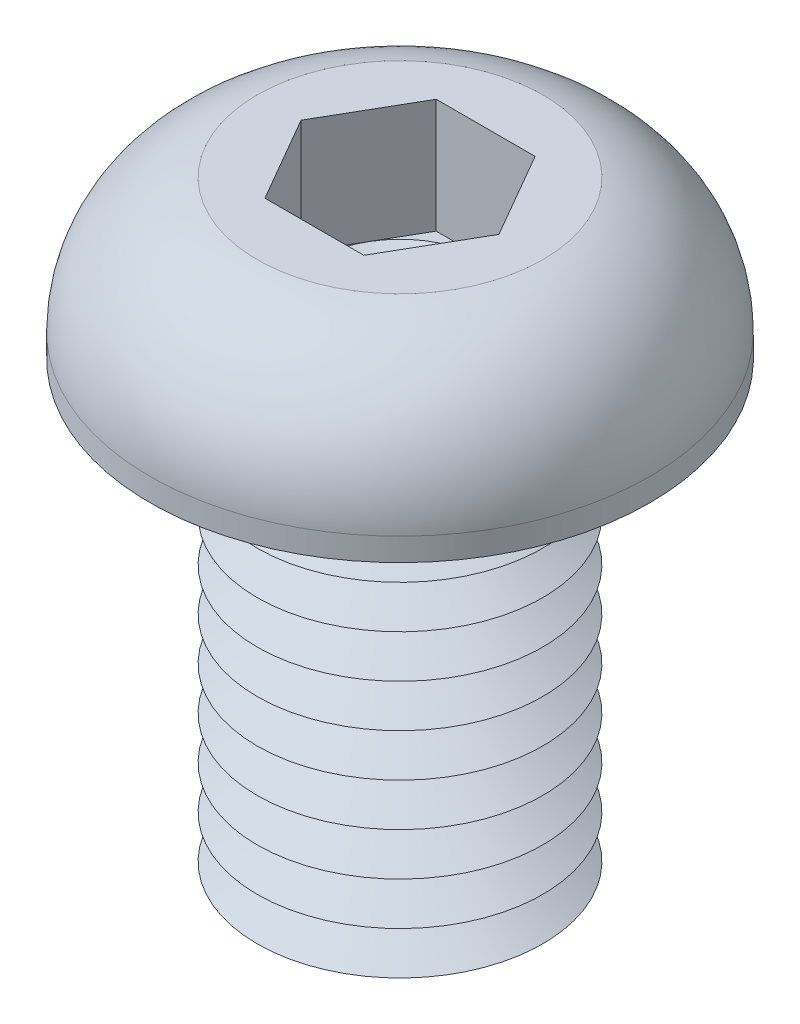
ISO-10303-21;
HEADER;
FILE_DESCRIPTION(('STEP AP214'),'2;1');
FILE_NAME('part.step','',(''),(''),'','','');
FILE_SCHEMA(('AUTOMOTIVE_DESIGN { 1 0 10303 214 1 1 1 1 }'));
ENDSEC;
DATA;
#1=APPLICATION_CONTEXT('core data for automotive mechanical design processes');
#2=APPLICATION_PROTOCOL_DEFINITION('international standard','automotive_design',2000,#1);
#3=PRODUCT_CONTEXT('',#1,'mechanical');
#4=PRODUCT('Part','Part','',(#3));
#5=PRODUCT_RELATED_PRODUCT_CATEGORY('part','',(#4));
#6=PRODUCT_DEFINITION_FORMATION('','',#4);
#7=PRODUCT_DEFINITION_CONTEXT('part definition',#1,'design');
#8=PRODUCT_DEFINITION('design','',#6,#7);
#9=PRODUCT_DEFINITION_SHAPE('','',#8);
#10=(LENGTH_UNIT() NAMED_UNIT(*) SI_UNIT(.MILLI.,.METRE.));
#11=(NAMED_UNIT(*) PLANE_ANGLE_UNIT() SI_UNIT($,.RADIAN.));
#12=(NAMED_UNIT(*) SI_UNIT($,.STERADIAN.) SOLID_ANGLE_UNIT());
#13=UNCERTAINTY_MEASURE_WITH_UNIT(LENGTH_MEASURE(1.E-05),#10,'distance_accuracy_value','');
#14=(GEOMETRIC_REPRESENTATION_CONTEXT(3) GLOBAL_UNCERTAINTY_ASSIGNED_CONTEXT((#13)) GLOBAL_UNIT_ASSIGNED_CONTEXT((#10,
#11,#12)) REPRESENTATION_CONTEXT('',''));
#15=CARTESIAN_POINT('',(0.,0.,0.));
#16=DIRECTION('',(0.,0.,1.));
#17=DIRECTION('',(1.,0.,0.));
#18=AXIS2_PLACEMENT_3D('',#15,#16,#17);
#19=CARTESIAN_POINT('',(0.,0.,0.));
#20=DIRECTION('',(0.,-1.,0.));
#21=DIRECTION('',(0.,0.,-1.));
#22=AXIS2_PLACEMENT_3D('',#19,#20,#21);
#23=TOROIDAL_SURFACE('',#22,5.75,0.75);
#24=CARTESIAN_POINT('',(0.,0.,-6.5));
#25=VERTEX_POINT('',#24);
#26=VERTEX_LOOP('',#25);
#27=FACE_BOUND('',#26,.T.);
#28=ADVANCED_FACE('P0_F12',(#27),#23,.T.);
#29=CLOSED_SHELL('',(#28));
#30=MANIFOLD_SOLID_BREP('P0_B1',#29);
#31=CARTESIAN_POINT('',(1.73205080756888,1.5,-3.));
#32=DIRECTION('',(0.,1.,0.));
#33=DIRECTION('',(0.,0.,1.));
#34=AXIS2_PLACEMENT_3D('',#31,#32,#33);
#35=PLANE('',#34);
#36=CARTESIAN_POINT('',(0.,1.5,0.));
#37=DIRECTION('',(0.,1.,0.));
#38=DIRECTION('',(0.,0.,1.));
#39=AXIS2_PLACEMENT_3D('',#36,#37,#38);
#40=CIRCLE('',#39,3.);
#41=CARTESIAN_POINT('',(0.,1.5,3.));
#42=VERTEX_POINT('',#41);
#43=CARTESIAN_POINT('',(2.59807621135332,1.5,1.5));
#44=VERTEX_POINT('',#43);
#45=EDGE_CURVE('P1_E93',#42,#44,#40,.T.);
#46=ORIENTED_EDGE('',*,*,#45,.F.);
#47=DIRECTION('',(1.,0.,0.));
#48=VECTOR('',#47,1.);
#49=CARTESIAN_POINT('',(-1.73205080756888,1.5,3.));
#50=LINE('',#49,#48);
#51=CARTESIAN_POINT('',(1.73205080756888,1.5,3.));
#52=VERTEX_POINT('',#51);
#53=EDGE_CURVE('P1_E116',#42,#52,#50,.T.);
#54=ORIENTED_EDGE('',*,*,#53,.T.);
#55=DIRECTION('',(0.5,0.,-0.866025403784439));
#56=VECTOR('',#55,1.);
#57=CARTESIAN_POINT('',(1.73205080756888,1.5,3.));
#58=LINE('',#57,#56);
#59=EDGE_CURVE('P1_E112',#52,#44,#58,.T.);
#60=ORIENTED_EDGE('',*,*,#59,.T.);
#61=EDGE_LOOP('',(#46,#54,#60));
#62=FACE_BOUND('',#61,.T.);
#63=ADVANCED_FACE('P1_F15',(#62),#35,.T.);
#64=CARTESIAN_POINT('',(0.,1.5,0.));
#65=DIRECTION('',(0.,1.,0.));
#66=DIRECTION('',(0.,0.,1.));
#67=AXIS2_PLACEMENT_3D('',#64,#65,#66);
#68=CIRCLE('',#67,3.);
#69=CARTESIAN_POINT('',(2.59807621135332,1.5,-1.5));
#70=VERTEX_POINT('',#69);
#71=EDGE_CURVE('P1_E10',#44,#70,#68,.T.);
#72=ORIENTED_EDGE('',*,*,#71,.F.);
#73=CARTESIAN_POINT('',(3.46410161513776,1.5,0.));
#74=VERTEX_POINT('',#73);
#75=EDGE_CURVE('P1_E104',#44,#74,#58,.T.);
#76=ORIENTED_EDGE('',*,*,#75,.T.);
#77=DIRECTION('',(-0.5,0.,-0.866025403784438));
#78=VECTOR('',#77,1.);
#79=CARTESIAN_POINT('',(3.46410161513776,1.5,0.));
#80=LINE('',#79,#78);
#81=EDGE_CURVE('P1_E107',#74,#70,#80,.T.);
#82=ORIENTED_EDGE('',*,*,#81,.T.);
#83=EDGE_LOOP('',(#72,#76,#82));
#84=FACE_BOUND('',#83,.T.);
#85=ADVANCED_FACE('P1_F103',(#84),#35,.T.);
#86=CARTESIAN_POINT('',(0.,1.5,-3.));
#87=VERTEX_POINT('',#86);
#88=EDGE_CURVE('P1_E24',#70,#87,#68,.T.);
#89=ORIENTED_EDGE('',*,*,#88,.F.);
#90=CARTESIAN_POINT('',(1.73205080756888,1.5,-3.));
#91=VERTEX_POINT('',#90);
#92=EDGE_CURVE('P1_E139',#70,#91,#80,.T.);
#93=ORIENTED_EDGE('',*,*,#92,.T.);
#94=DIRECTION('',(-1.,0.,0.));
#95=VECTOR('',#94,1.);
#96=CARTESIAN_POINT('',(1.73205080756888,1.5,-3.));
#97=LINE('',#96,#95);
#98=EDGE_CURVE('P1_E282',#91,#87,#97,.T.);
#99=ORIENTED_EDGE('',*,*,#98,.T.);
#100=EDGE_LOOP('',(#89,#93,#99));
#101=FACE_BOUND('',#100,.T.);
#102=ADVANCED_FACE('P1_F247',(#101),#35,.T.);
#103=CARTESIAN_POINT('',(-2.59807621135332,1.5,-1.5));
#104=VERTEX_POINT('',#103);
#105=EDGE_CURVE('P1_E277',#87,#104,#68,.T.);
#106=ORIENTED_EDGE('',*,*,#105,.F.);
#107=CARTESIAN_POINT('',(-1.73205080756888,1.5,-3.));
#108=VERTEX_POINT('',#107);
#109=EDGE_CURVE('P1_E286',#87,#108,#97,.T.);
#110=ORIENTED_EDGE('',*,*,#109,.T.);
#111=DIRECTION('',(-0.5,0.,0.866025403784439));
#112=VECTOR('',#111,1.);
#113=CARTESIAN_POINT('',(-1.73205080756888,1.5,-3.));
#114=LINE('',#113,#112);
#115=EDGE_CURVE('P1_E281',#108,#104,#114,.T.);
#116=ORIENTED_EDGE('',*,*,#115,.T.);
#117=EDGE_LOOP('',(#106,#110,#116));
#118=FACE_BOUND('',#117,.T.);
#119=ADVANCED_FACE('P1_F261',(#118),#35,.T.);
#120=CARTESIAN_POINT('',(-2.59807621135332,1.5,1.5));
#121=VERTEX_POINT('',#120);
#122=EDGE_CURVE('P1_E31',#104,#121,#68,.T.);
#123=ORIENTED_EDGE('',*,*,#122,.F.);
#124=CARTESIAN_POINT('',(-3.46410161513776,1.5,0.));
#125=VERTEX_POINT('',#124);
#126=EDGE_CURVE('P1_E273',#104,#125,#114,.T.);
#127=ORIENTED_EDGE('',*,*,#126,.T.);
#128=DIRECTION('',(0.5,0.,0.866025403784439));
#129=VECTOR('',#128,1.);
#130=CARTESIAN_POINT('',(-3.46410161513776,1.5,0.));
#131=LINE('',#130,#129);
#132=EDGE_CURVE('P1_E276',#125,#121,#131,.T.);
#133=ORIENTED_EDGE('',*,*,#132,.T.);
#134=EDGE_LOOP('',(#123,#127,#133));
#135=FACE_BOUND('',#134,.T.);
#136=ADVANCED_FACE('P1_F252',(#135),#35,.T.);
#137=CARTESIAN_POINT('',(0.,-14.5,0.));
#138=DIRECTION('',(0.,1.,0.));
#139=DIRECTION('',(0.,0.,1.));
#140=AXIS2_PLACEMENT_3D('',#137,#138,#139);
#141=CONICAL_SURFACE('',#140,3.70096189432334,1.0471975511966);
#142=CARTESIAN_POINT('',(0.,-13.75,0.));
#143=DIRECTION('',(0.,-1.,0.));
#144=DIRECTION('',(0.,0.,-1.));
#145=AXIS2_PLACEMENT_3D('',#142,#143,#144);
#146=CIRCLE('',#145,5.);
#147=CARTESIAN_POINT('',(0.,-13.75,-5.));
#148=VERTEX_POINT('',#147);
#149=EDGE_CURVE('P1_E209',#148,#148,#146,.T.);
#150=ORIENTED_EDGE('',*,*,#149,.T.);
#151=EDGE_LOOP('',(#150));
#152=FACE_BOUND('',#151,.T.);
#153=CARTESIAN_POINT('',(0.,-14.5,0.));
#154=DIRECTION('',(0.,-1.,0.));
#155=DIRECTION('',(0.,0.,-1.));
#156=AXIS2_PLACEMENT_3D('',#153,#154,#155);
#157=CIRCLE('',#156,3.70096189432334);
#158=CARTESIAN_POINT('',(0.,-14.5,-3.70096189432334));
#159=VERTEX_POINT('',#158);
#160=EDGE_CURVE('P1_E212',#159,#159,#157,.T.);
#161=ORIENTED_EDGE('',*,*,#160,.F.);
#162=EDGE_LOOP('',(#161));
#163=FACE_BOUND('',#162,.T.);
#164=ADVANCED_FACE('P1_F260',(#152,#163),#141,.T.);
#165=CARTESIAN_POINT('',(0.,-15.25,0.));
#166=DIRECTION('',(0.,-1.,0.));
#167=DIRECTION('',(0.,0.,-1.));
#168=AXIS2_PLACEMENT_3D('',#165,#166,#167);
#169=CONICAL_SURFACE('',#168,5.,1.0471975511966);
#170=ORIENTED_EDGE('',*,*,#160,.T.);
#171=EDGE_LOOP('',(#170));
#172=FACE_BOUND('',#171,.T.);
#173=CARTESIAN_POINT('',(0.,-15.25,0.));
#174=DIRECTION('',(0.,-1.,0.));
#175=DIRECTION('',(0.,0.,-1.));
#176=AXIS2_PLACEMENT_3D('',#173,#174,#175);
#177=CIRCLE('',#176,5.);
#178=CARTESIAN_POINT('',(0.,-15.25,-5.));
#179=VERTEX_POINT('',#178);
#180=EDGE_CURVE('P1_E215',#179,#179,#177,.T.);
#181=ORIENTED_EDGE('',*,*,#180,.F.);
#182=EDGE_LOOP('',(#181));
#183=FACE_BOUND('',#182,.T.);
#184=ADVANCED_FACE('P1_F267',(#172,#183),#169,.T.);
#185=CARTESIAN_POINT('',(0.,-16.,0.));
#186=DIRECTION('',(0.,1.,0.));
#187=DIRECTION('',(0.,0.,1.));
#188=AXIS2_PLACEMENT_3D('',#185,#186,#187);
#189=PLANE('',#188);
#190=CARTESIAN_POINT('',(0.,-16.,0.));
#191=DIRECTION('',(0.,-1.,0.));
#192=DIRECTION('',(0.,0.,-1.));
#193=AXIS2_PLACEMENT_3D('',#190,#191,#192);
#194=CIRCLE('',#193,3.70096189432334);
#195=CARTESIAN_POINT('',(0.,-16.,-3.70096189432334));
#196=VERTEX_POINT('',#195);
#197=EDGE_CURVE('P1_E218',#196,#196,#194,.T.);
#198=ORIENTED_EDGE('',*,*,#197,.T.);
#199=EDGE_LOOP('',(#198));
#200=FACE_BOUND('',#199,.T.);
#201=ADVANCED_FACE('P1_F345',(#200),#189,.F.);
#202=CARTESIAN_POINT('',(0.,-16.,0.));
#203=DIRECTION('',(0.,1.,0.));
#204=DIRECTION('',(0.,0.,1.));
#205=AXIS2_PLACEMENT_3D('',#202,#203,#204);
#206=CONICAL_SURFACE('',#205,3.70096189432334,1.0471975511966);
#207=ORIENTED_EDGE('',*,*,#180,.T.);
#208=EDGE_LOOP('',(#207));
#209=FACE_BOUND('',#208,.T.);
#210=ORIENTED_EDGE('',*,*,#197,.F.);
#211=EDGE_LOOP('',(#210));
#212=FACE_BOUND('',#211,.T.);
#213=ADVANCED_FACE('P1_F356',(#209,#212),#206,.T.);
#214=CARTESIAN_POINT('',(0.,-13.,0.));
#215=DIRECTION('',(0.,1.,0.));
#216=DIRECTION('',(0.,0.,1.));
#217=AXIS2_PLACEMENT_3D('',#214,#215,#216);
#218=CONICAL_SURFACE('',#217,3.70096189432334,1.0471975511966);
#219=CARTESIAN_POINT('',(0.,-12.25,0.));
#220=DIRECTION('',(0.,-1.,0.));
#221=DIRECTION('',(0.,0.,-1.));
#222=AXIS2_PLACEMENT_3D('',#219,#220,#221);
#223=CIRCLE('',#222,5.);
#224=CARTESIAN_POINT('',(0.,-12.25,-5.));
#225=VERTEX_POINT('',#224);
#226=EDGE_CURVE('P1_E203',#225,#225,#223,.T.);
#227=ORIENTED_EDGE('',*,*,#226,.T.);
#228=EDGE_LOOP('',(#227));
#229=FACE_BOUND('',#228,.T.);
#230=CARTESIAN_POINT('',(0.,-13.,0.));
#231=DIRECTION('',(0.,-1.,0.));
#232=DIRECTION('',(0.,0.,-1.));
#233=AXIS2_PLACEMENT_3D('',#230,#231,#232);
#234=CIRCLE('',#233,3.70096189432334);
#235=CARTESIAN_POINT('',(0.,-13.,-3.70096189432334));
#236=VERTEX_POINT('',#235);
#237=EDGE_CURVE('P1_E206',#236,#236,#234,.T.);
#238=ORIENTED_EDGE('',*,*,#237,.F.);
#239=EDGE_LOOP('',(#238));
#240=FACE_BOUND('',#239,.T.);
#241=ADVANCED_FACE('P1_F365',(#229,#240),#218,.T.);
#242=CARTESIAN_POINT('',(0.,-13.75,0.));
#243=DIRECTION('',(0.,-1.,0.));
#244=DIRECTION('',(0.,0.,-1.));
#245=AXIS2_PLACEMENT_3D('',#242,#243,#244);
#246=CONICAL_SURFACE('',#245,5.,1.0471975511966);
#247=ORIENTED_EDGE('',*,*,#237,.T.);
#248=EDGE_LOOP('',(#247));
#249=FACE_BOUND('',#248,.T.);
#250=ORIENTED_EDGE('',*,*,#149,.F.);
#251=EDGE_LOOP('',(#250));
#252=FACE_BOUND('',#251,.T.);
#253=ADVANCED_FACE('P1_F374',(#249,#252),#246,.T.);
#254=CARTESIAN_POINT('',(0.,-11.5,0.));
#255=DIRECTION('',(0.,1.,0.));
#256=DIRECTION('',(0.,0.,1.));
#257=AXIS2_PLACEMENT_3D('',#254,#255,#256);
#258=CONICAL_SURFACE('',#257,3.70096189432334,1.0471975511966);
#259=CARTESIAN_POINT('',(0.,-10.75,0.));
#260=DIRECTION('',(0.,-1.,0.));
#261=DIRECTION('',(0.,0.,-1.));
#262=AXIS2_PLACEMENT_3D('',#259,#260,#261);
#263=CIRCLE('',#262,5.);
#264=CARTESIAN_POINT('',(0.,-10.75,-5.));
#265=VERTEX_POINT('',#264);
#266=EDGE_CURVE('P1_E197',#265,#265,#263,.T.);
#267=ORIENTED_EDGE('',*,*,#266,.T.);
#268=EDGE_LOOP('',(#267));
#269=FACE_BOUND('',#268,.T.);
#270=CARTESIAN_POINT('',(0.,-11.5,0.));
#271=DIRECTION('',(0.,-1.,0.));
#272=DIRECTION('',(0.,0.,-1.));
#273=AXIS2_PLACEMENT_3D('',#270,#271,#272);
#274=CIRCLE('',#273,3.70096189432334);
#275=CARTESIAN_POINT('',(0.,-11.5,-3.70096189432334));
#276=VERTEX_POINT('',#275);
#277=EDGE_CURVE('P1_E200',#276,#276,#274,.T.);
#278=ORIENTED_EDGE('',*,*,#277,.F.);
#279=EDGE_LOOP('',(#278));
#280=FACE_BOUND('',#279,.T.);
#281=ADVANCED_FACE('P1_F384',(#269,#280),#258,.T.);
#282=CARTESIAN_POINT('',(0.,-12.25,0.));
#283=DIRECTION('',(0.,-1.,0.));
#284=DIRECTION('',(0.,0.,-1.));
#285=AXIS2_PLACEMENT_3D('',#282,#283,#284);
#286=CONICAL_SURFACE('',#285,5.,1.0471975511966);
#287=ORIENTED_EDGE('',*,*,#277,.T.);
#288=EDGE_LOOP('',(#287));
#289=FACE_BOUND('',#288,.T.);
#290=ORIENTED_EDGE('',*,*,#226,.F.);
#291=EDGE_LOOP('',(#290));
#292=FACE_BOUND('',#291,.T.);
#293=ADVANCED_FACE('P1_F394',(#289,#292),#286,.T.);
#294=CARTESIAN_POINT('',(0.,-10.,0.));
#295=DIRECTION('',(0.,1.,0.));
#296=DIRECTION('',(0.,0.,1.));
#297=AXIS2_PLACEMENT_3D('',#294,#295,#296);
#298=CONICAL_SURFACE('',#297,3.70096189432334,1.0471975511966);
#299=CARTESIAN_POINT('',(0.,-9.25,0.));
#300=DIRECTION('',(0.,-1.,0.));
#301=DIRECTION('',(0.,0.,-1.));
#302=AXIS2_PLACEMENT_3D('',#299,#300,#301);
#303=CIRCLE('',#302,5.);
#304=CARTESIAN_POINT('',(0.,-9.25,-5.));
#305=VERTEX_POINT('',#304);
#306=EDGE_CURVE('P1_E191',#305,#305,#303,.T.);
#307=ORIENTED_EDGE('',*,*,#306,.T.);
#308=EDGE_LOOP('',(#307));
#309=FACE_BOUND('',#308,.T.);
#310=CARTESIAN_POINT('',(0.,-10.,0.));
#311=DIRECTION('',(0.,-1.,0.));
#312=DIRECTION('',(0.,0.,-1.));
#313=AXIS2_PLACEMENT_3D('',#310,#311,#312);
#314=CIRCLE('',#313,3.70096189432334);
#315=CARTESIAN_POINT('',(0.,-10.,-3.70096189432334));
#316=VERTEX_POINT('',#315);
#317=EDGE_CURVE('P1_E194',#316,#316,#314,.T.);
#318=ORIENTED_EDGE('',*,*,#317,.F.);
#319=EDGE_LOOP('',(#318));
#320=FACE_BOUND('',#319,.T.);
#321=ADVANCED_FACE('P1_F404',(#309,#320),#298,.T.);
#322=CARTESIAN_POINT('',(0.,-10.75,0.));
#323=DIRECTION('',(0.,-1.,0.));
#324=DIRECTION('',(0.,0.,-1.));
#325=AXIS2_PLACEMENT_3D('',#322,#323,#324);
#326=CONICAL_SURFACE('',#325,5.,1.0471975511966);
#327=ORIENTED_EDGE('',*,*,#317,.T.);
#328=EDGE_LOOP('',(#327));
#329=FACE_BOUND('',#328,.T.);
#330=ORIENTED_EDGE('',*,*,#266,.F.);
#331=EDGE_LOOP('',(#330));
#332=FACE_BOUND('',#331,.T.);
#333=ADVANCED_FACE('P1_F414',(#329,#332),#326,.T.);
#334=CARTESIAN_POINT('',(0.,-8.5,0.));
#335=DIRECTION('',(0.,1.,0.));
#336=DIRECTION('',(0.,0.,1.));
#337=AXIS2_PLACEMENT_3D('',#334,#335,#336);
#338=CONICAL_SURFACE('',#337,3.70096189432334,1.0471975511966);
#339=CARTESIAN_POINT('',(0.,-7.75,0.));
#340=DIRECTION('',(0.,-1.,0.));
#341=DIRECTION('',(0.,0.,-1.));
#342=AXIS2_PLACEMENT_3D('',#339,#340,#341);
#343=CIRCLE('',#342,5.);
#344=CARTESIAN_POINT('',(0.,-7.75,-5.));
#345=VERTEX_POINT('',#344);
#346=EDGE_CURVE('P1_E185',#345,#345,#343,.T.);
#347=ORIENTED_EDGE('',*,*,#346,.T.);
#348=EDGE_LOOP('',(#347));
#349=FACE_BOUND('',#348,.T.);
#350=CARTESIAN_POINT('',(0.,-8.5,0.));
#351=DIRECTION('',(0.,-1.,0.));
#352=DIRECTION('',(0.,0.,-1.));
#353=AXIS2_PLACEMENT_3D('',#350,#351,#352);
#354=CIRCLE('',#353,3.70096189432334);
#355=CARTESIAN_POINT('',(0.,-8.5,-3.70096189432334));
#356=VERTEX_POINT('',#355);
#357=EDGE_CURVE('P1_E188',#356,#356,#354,.T.);
#358=ORIENTED_EDGE('',*,*,#357,.F.);
#359=EDGE_LOOP('',(#358));
#360=FACE_BOUND('',#359,.T.);
#361=ADVANCED_FACE('P1_F424',(#349,#360),#338,.T.);
#362=CARTESIAN_POINT('',(0.,-9.25,0.));
#363=DIRECTION('',(0.,-1.,0.));
#364=DIRECTION('',(0.,0.,-1.));
#365=AXIS2_PLACEMENT_3D('',#362,#363,#364);
#366=CONICAL_SURFACE('',#365,5.,1.0471975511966);
#367=ORIENTED_EDGE('',*,*,#357,.T.);
#368=EDGE_LOOP('',(#367));
#369=FACE_BOUND('',#368,.T.);
#370=ORIENTED_EDGE('',*,*,#306,.F.);
#371=EDGE_LOOP('',(#370));
#372=FACE_BOUND('',#371,.T.);
#373=ADVANCED_FACE('P1_F434',(#369,#372),#366,.T.);
#374=CARTESIAN_POINT('',(0.,-7.,0.));
#375=DIRECTION('',(0.,1.,0.));
#376=DIRECTION('',(0.,0.,1.));
#377=AXIS2_PLACEMENT_3D('',#374,#375,#376);
#378=CONICAL_SURFACE('',#377,3.70096189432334,1.0471975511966);
#379=CARTESIAN_POINT('',(0.,-6.25,0.));
#380=DIRECTION('',(0.,-1.,0.));
#381=DIRECTION('',(0.,0.,-1.));
#382=AXIS2_PLACEMENT_3D('',#379,#380,#381);
#383=CIRCLE('',#382,5.);
#384=CARTESIAN_POINT('',(0.,-6.25,-5.));
#385=VERTEX_POINT('',#384);
#386=EDGE_CURVE('P1_E179',#385,#385,#383,.T.);
#387=ORIENTED_EDGE('',*,*,#386,.T.);
#388=EDGE_LOOP('',(#387));
#389=FACE_BOUND('',#388,.T.);
#390=CARTESIAN_POINT('',(0.,-7.,0.));
#391=DIRECTION('',(0.,-1.,0.));
#392=DIRECTION('',(0.,0.,-1.));
#393=AXIS2_PLACEMENT_3D('',#390,#391,#392);
#394=CIRCLE('',#393,3.70096189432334);
#395=CARTESIAN_POINT('',(0.,-7.,-3.70096189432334));
#396=VERTEX_POINT('',#395);
#397=EDGE_CURVE('P1_E182',#396,#396,#394,.T.);
#398=ORIENTED_EDGE('',*,*,#397,.F.);
#399=EDGE_LOOP('',(#398));
#400=FACE_BOUND('',#399,.T.);
#401=ADVANCED_FACE('P1_F444',(#389,#400),#378,.T.);
#402=CARTESIAN_POINT('',(0.,-7.75,0.));
#403=DIRECTION('',(0.,-1.,0.));
#404=DIRECTION('',(0.,0.,-1.));
#405=AXIS2_PLACEMENT_3D('',#402,#403,#404);
#406=CONICAL_SURFACE('',#405,5.,1.0471975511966);
#407=ORIENTED_EDGE('',*,*,#397,.T.);
#408=EDGE_LOOP('',(#407));
#409=FACE_BOUND('',#408,.T.);
#410=ORIENTED_EDGE('',*,*,#346,.F.);
#411=EDGE_LOOP('',(#410));
#412=FACE_BOUND('',#411,.T.);
#413=ADVANCED_FACE('P1_F454',(#409,#412),#406,.T.);
#414=CARTESIAN_POINT('',(0.,-5.5,0.));
#415=DIRECTION('',(0.,1.,0.));
#416=DIRECTION('',(0.,0.,1.));
#417=AXIS2_PLACEMENT_3D('',#414,#415,#416);
#418=CONICAL_SURFACE('',#417,3.70096189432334,1.0471975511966);
#419=CARTESIAN_POINT('',(0.,-4.75,0.));
#420=DIRECTION('',(0.,-1.,0.));
#421=DIRECTION('',(0.,0.,-1.));
#422=AXIS2_PLACEMENT_3D('',#419,#420,#421);
#423=CIRCLE('',#422,5.);
#424=CARTESIAN_POINT('',(0.,-4.75,-5.));
#425=VERTEX_POINT('',#424);
#426=EDGE_CURVE('P1_E173',#425,#425,#423,.T.);
#427=ORIENTED_EDGE('',*,*,#426,.T.);
#428=EDGE_LOOP('',(#427));
#429=FACE_BOUND('',#428,.T.);
#430=CARTESIAN_POINT('',(0.,-5.5,0.));
#431=DIRECTION('',(0.,-1.,0.));
#432=DIRECTION('',(0.,0.,-1.));
#433=AXIS2_PLACEMENT_3D('',#430,#431,#432);
#434=CIRCLE('',#433,3.70096189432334);
#435=CARTESIAN_POINT('',(0.,-5.5,-3.70096189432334));
#436=VERTEX_POINT('',#435);
#437=EDGE_CURVE('P1_E176',#436,#436,#434,.T.);
#438=ORIENTED_EDGE('',*,*,#437,.F.);
#439=EDGE_LOOP('',(#438));
#440=FACE_BOUND('',#439,.T.);
#441=ADVANCED_FACE('P1_F464',(#429,#440),#418,.T.);
#442=CARTESIAN_POINT('',(0.,-6.25,0.));
#443=DIRECTION('',(0.,-1.,0.));
#444=DIRECTION('',(0.,0.,-1.));
#445=AXIS2_PLACEMENT_3D('',#442,#443,#444);
#446=CONICAL_SURFACE('',#445,5.,1.0471975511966);
#447=ORIENTED_EDGE('',*,*,#437,.T.);
#448=EDGE_LOOP('',(#447));
#449=FACE_BOUND('',#448,.T.);
#450=ORIENTED_EDGE('',*,*,#386,.F.);
#451=EDGE_LOOP('',(#450));
#452=FACE_BOUND('',#451,.T.);
#453=ADVANCED_FACE('P1_F474',(#449,#452),#446,.T.);
#454=CARTESIAN_POINT('',(0.,-4.,0.));
#455=DIRECTION('',(0.,1.,0.));
#456=DIRECTION('',(0.,0.,1.));
#457=AXIS2_PLACEMENT_3D('',#454,#455,#456);
#458=CONICAL_SURFACE('',#457,3.70096189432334,1.0471975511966);
#459=CARTESIAN_POINT('',(0.,-3.25,0.));
#460=DIRECTION('',(0.,-1.,0.));
#461=DIRECTION('',(0.,0.,-1.));
#462=AXIS2_PLACEMENT_3D('',#459,#460,#461);
#463=CIRCLE('',#462,5.);
#464=CARTESIAN_POINT('',(0.,-3.25,-5.));
#465=VERTEX_POINT('',#464);
#466=EDGE_CURVE('P1_E164',#465,#465,#463,.T.);
#467=ORIENTED_EDGE('',*,*,#466,.T.);
#468=EDGE_LOOP('',(#467));
#469=FACE_BOUND('',#468,.T.);
#470=CARTESIAN_POINT('',(0.,-4.,0.));
#471=DIRECTION('',(0.,-1.,0.));
#472=DIRECTION('',(0.,0.,-1.));
#473=AXIS2_PLACEMENT_3D('',#470,#471,#472);
#474=CIRCLE('',#473,3.70096189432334);
#475=CARTESIAN_POINT('',(0.,-4.,-3.70096189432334));
#476=VERTEX_POINT('',#475);
#477=EDGE_CURVE('P1_E170',#476,#476,#474,.T.);
#478=ORIENTED_EDGE('',*,*,#477,.F.);
#479=EDGE_LOOP('',(#478));
#480=FACE_BOUND('',#479,.T.);
#481=ADVANCED_FACE('P1_F484',(#469,#480),#458,.T.);
#482=CARTESIAN_POINT('',(0.,-4.75,0.));
#483=DIRECTION('',(0.,-1.,0.));
#484=DIRECTION('',(0.,0.,-1.));
#485=AXIS2_PLACEMENT_3D('',#482,#483,#484);
#486=CONICAL_SURFACE('',#485,5.,1.0471975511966);
#487=ORIENTED_EDGE('',*,*,#477,.T.);
#488=EDGE_LOOP('',(#487));
#489=FACE_BOUND('',#488,.T.);
#490=ORIENTED_EDGE('',*,*,#426,.F.);
#491=EDGE_LOOP('',(#490));
#492=FACE_BOUND('',#491,.T.);
#493=ADVANCED_FACE('P1_F494',(#489,#492),#486,.T.);
#494=CARTESIAN_POINT('',(0.,-2.5,0.));
#495=DIRECTION('',(0.,1.,0.));
#496=DIRECTION('',(0.,0.,1.));
#497=AXIS2_PLACEMENT_3D('',#494,#495,#496);
#498=CONICAL_SURFACE('',#497,3.70096189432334,1.0471975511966);
#499=CARTESIAN_POINT('',(0.,-1.75,0.));
#500=DIRECTION('',(0.,-1.,0.));
#501=DIRECTION('',(0.,0.,-1.));
#502=AXIS2_PLACEMENT_3D('',#499,#500,#501);
#503=CIRCLE('',#502,5.);
#504=CARTESIAN_POINT('',(0.,-1.75,-5.));
#505=VERTEX_POINT('',#504);
#506=EDGE_CURVE('P1_E167',#505,#505,#503,.T.);
#507=ORIENTED_EDGE('',*,*,#506,.T.);
#508=EDGE_LOOP('',(#507));
#509=FACE_BOUND('',#508,.T.);
#510=CARTESIAN_POINT('',(0.,-2.5,0.));
#511=DIRECTION('',(0.,-1.,0.));
#512=DIRECTION('',(0.,0.,-1.));
#513=AXIS2_PLACEMENT_3D('',#510,#511,#512);
#514=CIRCLE('',#513,3.70096189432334);
#515=CARTESIAN_POINT('',(0.,-2.5,-3.70096189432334));
#516=VERTEX_POINT('',#515);
#517=EDGE_CURVE('P1_E161',#516,#516,#514,.T.);
#518=ORIENTED_EDGE('',*,*,#517,.F.);
#519=EDGE_LOOP('',(#518));
#520=FACE_BOUND('',#519,.T.);
#521=ADVANCED_FACE('P1_F504',(#509,#520),#498,.T.);
#522=CARTESIAN_POINT('',(0.,-3.25,0.));
#523=DIRECTION('',(0.,-1.,0.));
#524=DIRECTION('',(0.,0.,-1.));
#525=AXIS2_PLACEMENT_3D('',#522,#523,#524);
#526=CONICAL_SURFACE('',#525,5.,1.0471975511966);
#527=ORIENTED_EDGE('',*,*,#517,.T.);
#528=EDGE_LOOP('',(#527));
#529=FACE_BOUND('',#528,.T.);
#530=ORIENTED_EDGE('',*,*,#466,.F.);
#531=EDGE_LOOP('',(#530));
#532=FACE_BOUND('',#531,.T.);
#533=ADVANCED_FACE('P1_F514',(#529,#532),#526,.T.);
#534=CARTESIAN_POINT('',(0.,-16.,0.));
#535=DIRECTION('',(0.,1.,0.));
#536=DIRECTION('',(0.,0.,1.));
#537=AXIS2_PLACEMENT_3D('',#534,#535,#536);
#538=CYLINDRICAL_SURFACE('',#537,5.);
#539=CARTESIAN_POINT('',(0.,0.,0.));
#540=DIRECTION('',(0.,-1.,0.));
#541=DIRECTION('',(1.,0.,0.));
#542=AXIS2_PLACEMENT_3D('',#539,#540,#541);
#543=CIRCLE('',#542,5.);
#544=CARTESIAN_POINT('',(5.,0.,0.));
#545=VERTEX_POINT('',#544);
#546=EDGE_CURVE('P1_E141',#545,#545,#543,.F.);
#547=ORIENTED_EDGE('',*,*,#546,.F.);
#548=EDGE_LOOP('',(#547));
#549=FACE_BOUND('',#548,.T.);
#550=ORIENTED_EDGE('',*,*,#506,.F.);
#551=EDGE_LOOP('',(#550));
#552=FACE_BOUND('',#551,.T.);
#553=ADVANCED_FACE('P1_F17',(#549,#552),#538,.T.);
#554=CARTESIAN_POINT('',(0.,0.,0.));
#555=DIRECTION('',(0.,-1.,0.));
#556=DIRECTION('',(0.,0.,-1.));
#557=AXIS2_PLACEMENT_3D('',#554,#555,#556);
#558=TOROIDAL_SURFACE('',#557,5.75,0.749999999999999);
#559=ORIENTED_EDGE('',*,*,#546,.T.);
#560=EDGE_LOOP('',(#559));
#561=FACE_BOUND('',#560,.T.);
#562=CARTESIAN_POINT('',(0.,0.,0.));
#563=DIRECTION('',(0.,1.,0.));
#564=DIRECTION('',(-1.,0.,0.));
#565=AXIS2_PLACEMENT_3D('',#562,#563,#564);
#566=CIRCLE('',#565,6.5);
#567=CARTESIAN_POINT('',(-6.5,0.,0.));
#568=VERTEX_POINT('',#567);
#569=EDGE_CURVE('P1_E151',#568,#568,#566,.F.);
#570=ORIENTED_EDGE('',*,*,#569,.T.);
#571=EDGE_LOOP('',(#570));
#572=FACE_BOUND('',#571,.T.);
#573=ADVANCED_FACE('P1_F223',(#561,#572),#558,.F.);
#574=CARTESIAN_POINT('',(5.,5.5,0.));
#575=DIRECTION('',(0.,-1.,0.));
#576=DIRECTION('',(1.,0.,0.));
#577=AXIS2_PLACEMENT_3D('',#574,#575,#576);
#578=PLANE('',#577);
#579=DIRECTION('',(-1.,0.,0.));
#580=VECTOR('',#579,1.);
#581=CARTESIAN_POINT('',(1.73205080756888,5.5,-3.));
#582=LINE('',#581,#580);
#583=CARTESIAN_POINT('',(1.73205080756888,5.5,-3.));
#584=VERTEX_POINT('',#583);
#585=CARTESIAN_POINT('',(-1.73205080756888,5.5,-3.));
#586=VERTEX_POINT('',#585);
#587=EDGE_CURVE('P1_E125',#584,#586,#582,.T.);
#588=ORIENTED_EDGE('',*,*,#587,.F.);
#589=DIRECTION('',(-0.5,0.,-0.866025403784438));
#590=VECTOR('',#589,1.);
#591=CARTESIAN_POINT('',(3.46410161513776,5.5,0.));
#592=LINE('',#591,#590);
#593=CARTESIAN_POINT('',(3.46410161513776,5.5,0.));
#594=VERTEX_POINT('',#593);
#595=EDGE_CURVE('P1_E39',#594,#584,#592,.T.);
#596=ORIENTED_EDGE('',*,*,#595,.F.);
#597=DIRECTION('',(0.5,0.,-0.866025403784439));
#598=VECTOR('',#597,1.);
#599=CARTESIAN_POINT('',(1.73205080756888,5.5,3.));
#600=LINE('',#599,#598);
#601=CARTESIAN_POINT('',(1.73205080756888,5.5,3.));
#602=VERTEX_POINT('',#601);
#603=EDGE_CURVE('P1_E137',#602,#594,#600,.T.);
#604=ORIENTED_EDGE('',*,*,#603,.F.);
#605=DIRECTION('',(1.,0.,0.));
#606=VECTOR('',#605,1.);
#607=CARTESIAN_POINT('',(-1.73205080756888,5.5,3.));
#608=LINE('',#607,#606);
#609=CARTESIAN_POINT('',(-1.73205080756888,5.5,3.));
#610=VERTEX_POINT('',#609);
#611=EDGE_CURVE('P1_E134',#610,#602,#608,.T.);
#612=ORIENTED_EDGE('',*,*,#611,.F.);
#613=DIRECTION('',(0.5,0.,0.866025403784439));
#614=VECTOR('',#613,1.);
#615=CARTESIAN_POINT('',(-3.46410161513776,5.5,0.));
#616=LINE('',#615,#614);
#617=CARTESIAN_POINT('',(-3.46410161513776,5.5,0.));
#618=VERTEX_POINT('',#617);
#619=EDGE_CURVE('P1_E131',#618,#610,#616,.T.);
#620=ORIENTED_EDGE('',*,*,#619,.F.);
#621=DIRECTION('',(-0.5,0.,0.866025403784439));
#622=VECTOR('',#621,1.);
#623=CARTESIAN_POINT('',(-1.73205080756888,5.5,-3.));
#624=LINE('',#623,#622);
#625=EDGE_CURVE('P1_E128',#586,#618,#624,.T.);
#626=ORIENTED_EDGE('',*,*,#625,.F.);
#627=EDGE_LOOP('',(#588,#596,#604,#612,#620,#626));
#628=FACE_BOUND('',#627,.T.);
#629=CARTESIAN_POINT('',(0.,5.5,0.));
#630=DIRECTION('',(0.,1.,0.));
#631=DIRECTION('',(-1.,0.,0.));
#632=AXIS2_PLACEMENT_3D('',#629,#630,#631);
#633=CIRCLE('',#632,5.);
#634=CARTESIAN_POINT('',(-5.,5.5,0.));
#635=VERTEX_POINT('',#634);
#636=EDGE_CURVE('P1_E152',#635,#635,#633,.T.);
#637=ORIENTED_EDGE('',*,*,#636,.T.);
#638=EDGE_LOOP('',(#637));
#639=FACE_BOUND('',#638,.T.);
#640=ADVANCED_FACE('P1_F301',(#628,#639),#578,.F.);
#641=CARTESIAN_POINT('',(0.,0.8,0.));
#642=DIRECTION('',(0.,1.,0.));
#643=DIRECTION('',(-1.,0.,0.));
#644=AXIS2_PLACEMENT_3D('',#641,#642,#643);
#645=DEGENERATE_TOROIDAL_SURFACE('',#644,3.92966666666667,4.82033333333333,.T.);
#646=ORIENTED_EDGE('',*,*,#636,.F.);
#647=EDGE_LOOP('',(#646));
#648=FACE_BOUND('',#647,.T.);
#649=CARTESIAN_POINT('',(0.,0.799999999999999,0.));
#650=DIRECTION('',(0.,1.,0.));
#651=DIRECTION('',(-1.,0.,0.));
#652=AXIS2_PLACEMENT_3D('',#649,#650,#651);
#653=CIRCLE('',#652,8.75);
#654=CARTESIAN_POINT('',(-8.75,0.799999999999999,0.));
#655=VERTEX_POINT('',#654);
#656=EDGE_CURVE('P1_E155',#655,#655,#653,.T.);
#657=ORIENTED_EDGE('',*,*,#656,.T.);
#658=EDGE_LOOP('',(#657));
#659=FACE_BOUND('',#658,.T.);
#660=ADVANCED_FACE('P1_F237',(#648,#659),#645,.T.);
#661=CARTESIAN_POINT('',(0.,5.5,0.));
#662=DIRECTION('',(0.,1.,0.));
#663=DIRECTION('',(-1.,0.,0.));
#664=AXIS2_PLACEMENT_3D('',#661,#662,#663);
#665=CYLINDRICAL_SURFACE('',#664,8.75);
#666=ORIENTED_EDGE('',*,*,#656,.F.);
#667=EDGE_LOOP('',(#666));
#668=FACE_BOUND('',#667,.T.);
#669=CARTESIAN_POINT('',(0.,0.,0.));
#670=DIRECTION('',(0.,1.,0.));
#671=DIRECTION('',(-1.,0.,0.));
#672=AXIS2_PLACEMENT_3D('',#669,#670,#671);
#673=CIRCLE('',#672,8.75);
#674=CARTESIAN_POINT('',(-8.75,0.,0.));
#675=VERTEX_POINT('',#674);
#676=EDGE_CURVE('P1_E158',#675,#675,#673,.T.);
#677=ORIENTED_EDGE('',*,*,#676,.T.);
#678=EDGE_LOOP('',(#677));
#679=FACE_BOUND('',#678,.T.);
#680=ADVANCED_FACE('P1_F228',(#668,#679),#665,.T.);
#681=CARTESIAN_POINT('',(0.,0.,0.));
#682=DIRECTION('',(0.,1.,0.));
#683=DIRECTION('',(-1.,0.,0.));
#684=AXIS2_PLACEMENT_3D('',#681,#682,#683);
#685=PLANE('',#684);
#686=ORIENTED_EDGE('',*,*,#676,.F.);
#687=EDGE_LOOP('',(#686));
#688=FACE_BOUND('',#687,.T.);
#689=ORIENTED_EDGE('',*,*,#569,.F.);
#690=EDGE_LOOP('',(#689));
#691=FACE_BOUND('',#690,.T.);
#692=ADVANCED_FACE('P1_F225',(#688,#691),#685,.F.);
#693=CARTESIAN_POINT('',(3.46410161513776,1.5,0.));
#694=DIRECTION('',(0.866025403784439,0.,-0.5));
#695=DIRECTION('',(-0.5,0.,-0.866025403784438));
#696=AXIS2_PLACEMENT_3D('',#693,#694,#695);
#697=PLANE('',#696);
#698=ORIENTED_EDGE('',*,*,#595,.T.);
#699=DIRECTION('',(0.,1.,0.));
#700=VECTOR('',#699,1.);
#701=CARTESIAN_POINT('',(1.73205080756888,1.5,-3.));
#702=LINE('',#701,#700);
#703=EDGE_CURVE('P1_E118',#91,#584,#702,.T.);
#704=ORIENTED_EDGE('',*,*,#703,.F.);
#705=ORIENTED_EDGE('',*,*,#92,.F.);
#706=ORIENTED_EDGE('',*,*,#81,.F.);
#707=DIRECTION('',(0.,1.,0.));
#708=VECTOR('',#707,1.);
#709=CARTESIAN_POINT('',(3.46410161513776,1.5,0.));
#710=LINE('',#709,#708);
#711=EDGE_CURVE('P1_E113',#74,#594,#710,.T.);
#712=ORIENTED_EDGE('',*,*,#711,.T.);
#713=EDGE_LOOP('',(#698,#704,#705,#706,#712));
#714=FACE_BOUND('',#713,.T.);
#715=ADVANCED_FACE('P1_F227',(#714),#697,.F.);
#716=CARTESIAN_POINT('',(1.73205080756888,1.5,3.));
#717=DIRECTION('',(0.866025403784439,0.,0.5));
#718=DIRECTION('',(0.5,0.,-0.866025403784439));
#719=AXIS2_PLACEMENT_3D('',#716,#717,#718);
#720=PLANE('',#719);
#721=ORIENTED_EDGE('',*,*,#603,.T.);
#722=ORIENTED_EDGE('',*,*,#711,.F.);
#723=ORIENTED_EDGE('',*,*,#75,.F.);
#724=ORIENTED_EDGE('',*,*,#59,.F.);
#725=DIRECTION('',(0.,1.,0.));
#726=VECTOR('',#725,1.);
#727=CARTESIAN_POINT('',(1.73205080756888,1.5,3.));
#728=LINE('',#727,#726);
#729=EDGE_CURVE('P1_E142',#52,#602,#728,.T.);
#730=ORIENTED_EDGE('',*,*,#729,.T.);
#731=EDGE_LOOP('',(#721,#722,#723,#724,#730));
#732=FACE_BOUND('',#731,.T.);
#733=ADVANCED_FACE('P1_F111',(#732),#720,.F.);
#734=CARTESIAN_POINT('',(-1.73205080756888,1.5,3.));
#735=DIRECTION('',(0.,0.,1.));
#736=DIRECTION('',(1.,0.,0.));
#737=AXIS2_PLACEMENT_3D('',#734,#735,#736);
#738=PLANE('',#737);
#739=ORIENTED_EDGE('',*,*,#611,.T.);
#740=ORIENTED_EDGE('',*,*,#729,.F.);
#741=ORIENTED_EDGE('',*,*,#53,.F.);
#742=CARTESIAN_POINT('',(-1.73205080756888,1.5,3.));
#743=VERTEX_POINT('',#742);
#744=EDGE_CURVE('P1_E114',#743,#42,#50,.T.);
#745=ORIENTED_EDGE('',*,*,#744,.F.);
#746=DIRECTION('',(0.,1.,0.));
#747=VECTOR('',#746,1.);
#748=CARTESIAN_POINT('',(-1.73205080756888,1.5,3.));
#749=LINE('',#748,#747);
#750=EDGE_CURVE('P1_E144',#743,#610,#749,.T.);
#751=ORIENTED_EDGE('',*,*,#750,.T.);
#752=EDGE_LOOP('',(#739,#740,#741,#745,#751));
#753=FACE_BOUND('',#752,.T.);
#754=ADVANCED_FACE('P1_F296',(#753),#738,.F.);
#755=CARTESIAN_POINT('',(-3.46410161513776,1.5,0.));
#756=DIRECTION('',(-0.866025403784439,0.,0.5));
#757=DIRECTION('',(0.5,0.,0.866025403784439));
#758=AXIS2_PLACEMENT_3D('',#755,#756,#757);
#759=PLANE('',#758);
#760=ORIENTED_EDGE('',*,*,#619,.T.);
#761=ORIENTED_EDGE('',*,*,#750,.F.);
#762=EDGE_CURVE('P1_E288',#121,#743,#131,.T.);
#763=ORIENTED_EDGE('',*,*,#762,.F.);
#764=ORIENTED_EDGE('',*,*,#132,.F.);
#765=DIRECTION('',(0.,1.,0.));
#766=VECTOR('',#765,1.);
#767=CARTESIAN_POINT('',(-3.46410161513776,1.5,0.));
#768=LINE('',#767,#766);
#769=EDGE_CURVE('P1_E146',#125,#618,#768,.T.);
#770=ORIENTED_EDGE('',*,*,#769,.T.);
#771=EDGE_LOOP('',(#760,#761,#763,#764,#770));
#772=FACE_BOUND('',#771,.T.);
#773=ADVANCED_FACE('P1_F592',(#772),#759,.F.);
#774=CARTESIAN_POINT('',(-1.73205080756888,1.5,-3.));
#775=DIRECTION('',(-0.866025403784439,0.,-0.5));
#776=DIRECTION('',(-0.5,0.,0.866025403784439));
#777=AXIS2_PLACEMENT_3D('',#774,#775,#776);
#778=PLANE('',#777);
#779=ORIENTED_EDGE('',*,*,#625,.T.);
#780=ORIENTED_EDGE('',*,*,#769,.F.);
#781=ORIENTED_EDGE('',*,*,#126,.F.);
#782=ORIENTED_EDGE('',*,*,#115,.F.);
#783=DIRECTION('',(0.,1.,0.));
#784=VECTOR('',#783,1.);
#785=CARTESIAN_POINT('',(-1.73205080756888,1.5,-3.));
#786=LINE('',#785,#784);
#787=EDGE_CURVE('P1_E119',#108,#586,#786,.T.);
#788=ORIENTED_EDGE('',*,*,#787,.T.);
#789=EDGE_LOOP('',(#779,#780,#781,#782,#788));
#790=FACE_BOUND('',#789,.T.);
#791=ADVANCED_FACE('P1_F256',(#790),#778,.F.);
#792=CARTESIAN_POINT('',(1.73205080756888,1.5,-3.));
#793=DIRECTION('',(0.,0.,-1.));
#794=DIRECTION('',(-1.,0.,0.));
#795=AXIS2_PLACEMENT_3D('',#792,#793,#794);
#796=PLANE('',#795);
#797=ORIENTED_EDGE('',*,*,#587,.T.);
#798=ORIENTED_EDGE('',*,*,#787,.F.);
#799=ORIENTED_EDGE('',*,*,#109,.F.);
#800=ORIENTED_EDGE('',*,*,#98,.F.);
#801=ORIENTED_EDGE('',*,*,#703,.T.);
#802=EDGE_LOOP('',(#797,#798,#799,#800,#801));
#803=FACE_BOUND('',#802,.T.);
#804=ADVANCED_FACE('P1_F250',(#803),#796,.F.);
#805=EDGE_CURVE('P1_E19',#121,#42,#68,.T.);
#806=ORIENTED_EDGE('',*,*,#805,.F.);
#807=ORIENTED_EDGE('',*,*,#762,.T.);
#808=ORIENTED_EDGE('',*,*,#744,.T.);
#809=EDGE_LOOP('',(#806,#807,#808));
#810=FACE_BOUND('',#809,.T.);
#811=ADVANCED_FACE('P1_F90',(#810),#35,.T.);
#812=CARTESIAN_POINT('',(0.,1.5,0.));
#813=DIRECTION('',(0.,1.,0.));
#814=DIRECTION('',(0.,0.,1.));
#815=AXIS2_PLACEMENT_3D('',#812,#813,#814);
#816=CONICAL_SURFACE('',#815,3.,1.0471975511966);
#817=CARTESIAN_POINT('',(0.,-0.232050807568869,0.));
#818=VERTEX_POINT('',#817);
#819=VERTEX_LOOP('',#818);
#820=FACE_BOUND('',#819,.T.);
#821=ORIENTED_EDGE('',*,*,#45,.T.);
#822=ORIENTED_EDGE('',*,*,#71,.T.);
#823=ORIENTED_EDGE('',*,*,#88,.T.);
#824=ORIENTED_EDGE('',*,*,#105,.T.);
#825=ORIENTED_EDGE('',*,*,#122,.T.);
#826=ORIENTED_EDGE('',*,*,#805,.T.);
#827=EDGE_LOOP('',(#821,#822,#823,#824,#825,#826));
#828=FACE_BOUND('',#827,.T.);
#829=ADVANCED_FACE('P1_F88',(#820,#828),#816,.F.);
#830=CLOSED_SHELL('',(#63,#85,#102,#119,#136,#164,#184,#201,#213,#241,#253,#281,#293,#321,#333,
#361,#373,#401,#413,#441,#453,#481,#493,#521,#533,#553,#573,#640,#660,#680,#692,#715,#733,#754,
#773,#791,#804,#811,#829));
#831=MANIFOLD_SOLID_BREP('P1_B1',#830);
#832=ADVANCED_BREP_SHAPE_REPRESENTATION('',(#18,#30,#831),#14);
#833=SHAPE_DEFINITION_REPRESENTATION(#9,#832);
ENDSEC;
END-ISO-10303-21;
